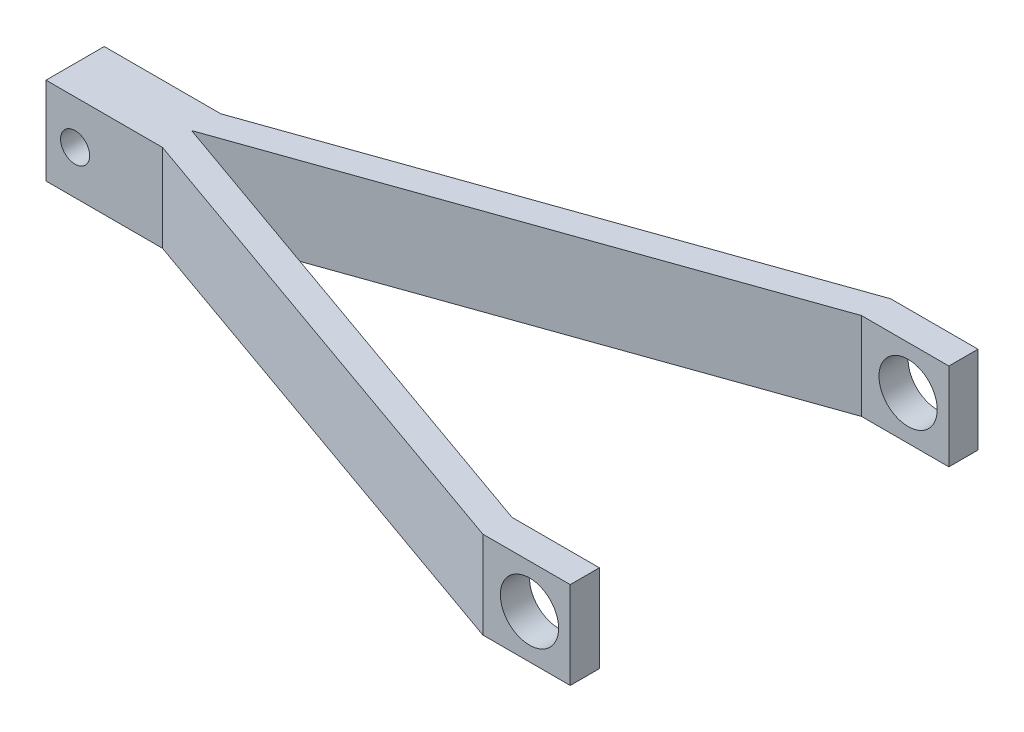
ISO-10303-21;
HEADER;
FILE_DESCRIPTION(('STEP AP214'),'2;1');
FILE_NAME('part.step','',(''),(''),'','','');
FILE_SCHEMA(('AUTOMOTIVE_DESIGN { 1 0 10303 214 1 1 1 1 }'));
ENDSEC;
DATA;
#1=APPLICATION_CONTEXT('core data for automotive mechanical design processes');
#2=APPLICATION_PROTOCOL_DEFINITION('international standard','automotive_design',2000,#1);
#3=PRODUCT_CONTEXT('',#1,'mechanical');
#4=PRODUCT('Part','Part','',(#3));
#5=PRODUCT_RELATED_PRODUCT_CATEGORY('part','',(#4));
#6=PRODUCT_DEFINITION_FORMATION('','',#4);
#7=PRODUCT_DEFINITION_CONTEXT('part definition',#1,'design');
#8=PRODUCT_DEFINITION('design','',#6,#7);
#9=PRODUCT_DEFINITION_SHAPE('','',#8);
#10=(LENGTH_UNIT() NAMED_UNIT(*) SI_UNIT(.MILLI.,.METRE.));
#11=(NAMED_UNIT(*) PLANE_ANGLE_UNIT() SI_UNIT($,.RADIAN.));
#12=(NAMED_UNIT(*) SI_UNIT($,.STERADIAN.) SOLID_ANGLE_UNIT());
#13=UNCERTAINTY_MEASURE_WITH_UNIT(LENGTH_MEASURE(1.E-05),#10,'distance_accuracy_value','');
#14=(GEOMETRIC_REPRESENTATION_CONTEXT(3) GLOBAL_UNCERTAINTY_ASSIGNED_CONTEXT((#13)) GLOBAL_UNIT_ASSIGNED_CONTEXT((#10,
#11,#12)) REPRESENTATION_CONTEXT('',''));
#15=CARTESIAN_POINT('',(0.,0.,0.));
#16=DIRECTION('',(0.,0.,1.));
#17=DIRECTION('',(1.,0.,0.));
#18=AXIS2_PLACEMENT_3D('',#15,#16,#17);
#19=CARTESIAN_POINT('',(99.9999999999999,7.5,2.77555756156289E-13));
#20=DIRECTION('',(-1.,0.,0.));
#21=DIRECTION('',(0.,0.,1.));
#22=AXIS2_PLACEMENT_3D('',#19,#20,#21);
#23=PLANE('',#22);
#24=DIRECTION('',(0.,0.,-1.));
#25=VECTOR('',#24,1.);
#26=CARTESIAN_POINT('',(99.9999999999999,-7.5,2.77555756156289E-13));
#27=LINE('',#26,#25);
#28=CARTESIAN_POINT('',(100.,-7.50000000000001,-30.));
#29=VERTEX_POINT('',#28);
#30=CARTESIAN_POINT('',(100.,-7.50000000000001,-35.));
#31=VERTEX_POINT('',#30);
#32=EDGE_CURVE('E165',#29,#31,#27,.T.);
#33=ORIENTED_EDGE('',*,*,#32,.T.);
#34=DIRECTION('',(0.,-1.,0.));
#35=VECTOR('',#34,1.);
#36=CARTESIAN_POINT('',(100.,7.49999999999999,-35.));
#37=LINE('',#36,#35);
#38=CARTESIAN_POINT('',(100.,7.49999999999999,-35.));
#39=VERTEX_POINT('',#38);
#40=EDGE_CURVE('E11',#39,#31,#37,.T.);
#41=ORIENTED_EDGE('',*,*,#40,.F.);
#42=DIRECTION('',(0.,0.,-1.));
#43=VECTOR('',#42,1.);
#44=CARTESIAN_POINT('',(99.9999999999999,7.5,2.77555756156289E-13));
#45=LINE('',#44,#43);
#46=CARTESIAN_POINT('',(100.,7.49999999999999,-30.));
#47=VERTEX_POINT('',#46);
#48=EDGE_CURVE('E197',#47,#39,#45,.T.);
#49=ORIENTED_EDGE('',*,*,#48,.F.);
#50=DIRECTION('',(0.,-1.,0.));
#51=VECTOR('',#50,1.);
#52=CARTESIAN_POINT('',(100.,7.49999999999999,-30.));
#53=LINE('',#52,#51);
#54=EDGE_CURVE('E164',#47,#29,#53,.T.);
#55=ORIENTED_EDGE('',*,*,#54,.T.);
#56=EDGE_LOOP('',(#33,#41,#49,#55));
#57=FACE_BOUND('',#56,.T.);
#58=ADVANCED_FACE('F36',(#57),#23,.F.);
#59=CARTESIAN_POINT('',(0.,7.5,-35.));
#60=DIRECTION('',(0.,0.,1.));
#61=DIRECTION('',(1.,0.,0.));
#62=AXIS2_PLACEMENT_3D('',#59,#60,#61);
#63=PLANE('',#62);
#64=CARTESIAN_POINT('',(93.,0.,-35.));
#65=DIRECTION('',(0.,0.,1.));
#66=DIRECTION('',(1.,0.,0.));
#67=AXIS2_PLACEMENT_3D('',#64,#65,#66);
#68=CIRCLE('',#67,5.);
#69=CARTESIAN_POINT('',(98.,0.,-35.));
#70=VERTEX_POINT('',#69);
#71=EDGE_CURVE('E371',#70,#70,#68,.T.);
#72=ORIENTED_EDGE('',*,*,#71,.T.);
#73=EDGE_LOOP('',(#72));
#74=FACE_BOUND('',#73,.T.);
#75=DIRECTION('',(-1.,0.,0.));
#76=VECTOR('',#75,1.);
#77=CARTESIAN_POINT('',(0.,-7.50000000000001,-35.));
#78=LINE('',#77,#76);
#79=CARTESIAN_POINT('',(85.,-7.5,-35.));
#80=VERTEX_POINT('',#79);
#81=EDGE_CURVE('E168',#31,#80,#78,.T.);
#82=ORIENTED_EDGE('',*,*,#81,.T.);
#83=DIRECTION('',(0.,-1.,0.));
#84=VECTOR('',#83,1.);
#85=CARTESIAN_POINT('',(85.,7.49999999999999,-35.));
#86=LINE('',#85,#84);
#87=CARTESIAN_POINT('',(85.,7.49999999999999,-35.));
#88=VERTEX_POINT('',#87);
#89=EDGE_CURVE('E45',#88,#80,#86,.T.);
#90=ORIENTED_EDGE('',*,*,#89,.F.);
#91=DIRECTION('',(-1.,0.,0.));
#92=VECTOR('',#91,1.);
#93=CARTESIAN_POINT('',(0.,7.5,-35.));
#94=LINE('',#93,#92);
#95=EDGE_CURVE('E110',#39,#88,#94,.T.);
#96=ORIENTED_EDGE('',*,*,#95,.F.);
#97=ORIENTED_EDGE('',*,*,#40,.T.);
#98=EDGE_LOOP('',(#82,#90,#96,#97));
#99=FACE_BOUND('',#98,.T.);
#100=ADVANCED_FACE('F275',(#74,#99),#63,.F.);
#101=CARTESIAN_POINT('',(-1.56923076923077,7.49999999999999,-4.44615384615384));
#102=DIRECTION('',(0.332820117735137,0.,0.942990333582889));
#103=DIRECTION('',(0.942990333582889,0.,-0.332820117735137));
#104=AXIS2_PLACEMENT_3D('',#101,#102,#103);
#105=PLANE('',#104);
#106=DIRECTION('',(-0.942990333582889,0.,0.332820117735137));
#107=VECTOR('',#106,1.);
#108=CARTESIAN_POINT('',(-1.56923076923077,-7.5,-4.44615384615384));
#109=LINE('',#108,#107);
#110=CARTESIAN_POINT('',(0.,-7.50000000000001,-5.));
#111=VERTEX_POINT('',#110);
#112=EDGE_CURVE('E171',#80,#111,#109,.T.);
#113=ORIENTED_EDGE('',*,*,#112,.T.);
#114=DIRECTION('',(0.,-1.,0.));
#115=VECTOR('',#114,1.);
#116=CARTESIAN_POINT('',(0.,7.5,-5.));
#117=LINE('',#116,#115);
#118=CARTESIAN_POINT('',(0.,7.5,-5.));
#119=VERTEX_POINT('',#118);
#120=EDGE_CURVE('E213',#119,#111,#117,.T.);
#121=ORIENTED_EDGE('',*,*,#120,.F.);
#122=DIRECTION('',(-0.942990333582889,0.,0.332820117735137));
#123=VECTOR('',#122,1.);
#124=CARTESIAN_POINT('',(-1.56923076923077,7.49999999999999,-4.44615384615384));
#125=LINE('',#124,#123);
#126=EDGE_CURVE('E222',#88,#119,#125,.T.);
#127=ORIENTED_EDGE('',*,*,#126,.F.);
#128=ORIENTED_EDGE('',*,*,#89,.T.);
#129=EDGE_LOOP('',(#113,#121,#127,#128));
#130=FACE_BOUND('',#129,.T.);
#131=ADVANCED_FACE('F220',(#130),#105,.F.);
#132=CARTESIAN_POINT('',(0.,7.5,-5.));
#133=DIRECTION('',(0.,0.,1.));
#134=DIRECTION('',(1.,0.,0.));
#135=AXIS2_PLACEMENT_3D('',#132,#133,#134);
#136=PLANE('',#135);
#137=CARTESIAN_POINT('',(-15.,0.,-5.00000000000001));
#138=DIRECTION('',(0.,0.,1.));
#139=DIRECTION('',(1.,0.,0.));
#140=AXIS2_PLACEMENT_3D('',#137,#138,#139);
#141=CIRCLE('',#140,2.5);
#142=CARTESIAN_POINT('',(-12.5,0.,-5.));
#143=VERTEX_POINT('',#142);
#144=EDGE_CURVE('E367',#143,#143,#141,.T.);
#145=ORIENTED_EDGE('',*,*,#144,.T.);
#146=EDGE_LOOP('',(#145));
#147=FACE_BOUND('',#146,.T.);
#148=DIRECTION('',(-1.,0.,0.));
#149=VECTOR('',#148,1.);
#150=CARTESIAN_POINT('',(0.,-7.50000000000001,-5.));
#151=LINE('',#150,#149);
#152=CARTESIAN_POINT('',(-20.,-7.49999999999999,-5.));
#153=VERTEX_POINT('',#152);
#154=EDGE_CURVE('E173',#111,#153,#151,.T.);
#155=ORIENTED_EDGE('',*,*,#154,.T.);
#156=DIRECTION('',(0.,-1.,0.));
#157=VECTOR('',#156,1.);
#158=CARTESIAN_POINT('',(-20.,7.49999999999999,-5.));
#159=LINE('',#158,#157);
#160=CARTESIAN_POINT('',(-20.,7.49999999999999,-5.));
#161=VERTEX_POINT('',#160);
#162=EDGE_CURVE('E211',#161,#153,#159,.T.);
#163=ORIENTED_EDGE('',*,*,#162,.F.);
#164=DIRECTION('',(-1.,0.,0.));
#165=VECTOR('',#164,1.);
#166=CARTESIAN_POINT('',(0.,7.5,-5.));
#167=LINE('',#166,#165);
#168=EDGE_CURVE('E233',#119,#161,#167,.T.);
#169=ORIENTED_EDGE('',*,*,#168,.F.);
#170=ORIENTED_EDGE('',*,*,#120,.T.);
#171=EDGE_LOOP('',(#155,#163,#169,#170));
#172=FACE_BOUND('',#171,.T.);
#173=ADVANCED_FACE('F230',(#147,#172),#136,.F.);
#174=CARTESIAN_POINT('',(-20.,7.49999999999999,0.));
#175=DIRECTION('',(-1.,0.,0.));
#176=DIRECTION('',(0.,0.,1.));
#177=AXIS2_PLACEMENT_3D('',#174,#175,#176);
#178=PLANE('',#177);
#179=DIRECTION('',(0.,0.,-1.));
#180=VECTOR('',#179,1.);
#181=CARTESIAN_POINT('',(-20.,-7.49999999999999,0.));
#182=LINE('',#181,#180);
#183=CARTESIAN_POINT('',(-20.,-7.49999999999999,5.00000000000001));
#184=VERTEX_POINT('',#183);
#185=EDGE_CURVE('E176',#184,#153,#182,.T.);
#186=ORIENTED_EDGE('',*,*,#185,.F.);
#187=DIRECTION('',(0.,-1.,0.));
#188=VECTOR('',#187,1.);
#189=CARTESIAN_POINT('',(-20.,7.49999999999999,5.00000000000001));
#190=LINE('',#189,#188);
#191=CARTESIAN_POINT('',(-20.,7.49999999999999,5.00000000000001));
#192=VERTEX_POINT('',#191);
#193=EDGE_CURVE('E209',#192,#184,#190,.T.);
#194=ORIENTED_EDGE('',*,*,#193,.F.);
#195=DIRECTION('',(0.,0.,-1.));
#196=VECTOR('',#195,1.);
#197=CARTESIAN_POINT('',(-20.,7.49999999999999,0.));
#198=LINE('',#197,#196);
#199=EDGE_CURVE('E235',#192,#161,#198,.T.);
#200=ORIENTED_EDGE('',*,*,#199,.T.);
#201=ORIENTED_EDGE('',*,*,#162,.T.);
#202=EDGE_LOOP('',(#186,#194,#200,#201));
#203=FACE_BOUND('',#202,.T.);
#204=ADVANCED_FACE('F288',(#203),#178,.T.);
#205=CARTESIAN_POINT('',(0.,7.5,5.));
#206=DIRECTION('',(0.,0.,1.));
#207=DIRECTION('',(1.,0.,0.));
#208=AXIS2_PLACEMENT_3D('',#205,#206,#207);
#209=PLANE('',#208);
#210=CARTESIAN_POINT('',(-15.,0.,5.));
#211=DIRECTION('',(0.,0.,1.));
#212=DIRECTION('',(1.,0.,0.));
#213=AXIS2_PLACEMENT_3D('',#210,#211,#212);
#214=CIRCLE('',#213,2.5);
#215=CARTESIAN_POINT('',(-12.5,0.,5.));
#216=VERTEX_POINT('',#215);
#217=EDGE_CURVE('E364',#216,#216,#214,.T.);
#218=ORIENTED_EDGE('',*,*,#217,.F.);
#219=EDGE_LOOP('',(#218));
#220=FACE_BOUND('',#219,.T.);
#221=DIRECTION('',(-1.,0.,0.));
#222=VECTOR('',#221,1.);
#223=CARTESIAN_POINT('',(0.,-7.50000000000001,5.));
#224=LINE('',#223,#222);
#225=CARTESIAN_POINT('',(0.,-7.50000000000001,5.));
#226=VERTEX_POINT('',#225);
#227=EDGE_CURVE('E179',#226,#184,#224,.T.);
#228=ORIENTED_EDGE('',*,*,#227,.F.);
#229=DIRECTION('',(0.,-1.,0.));
#230=VECTOR('',#229,1.);
#231=CARTESIAN_POINT('',(0.,7.5,5.));
#232=LINE('',#231,#230);
#233=CARTESIAN_POINT('',(0.,7.5,5.));
#234=VERTEX_POINT('',#233);
#235=EDGE_CURVE('E207',#234,#226,#232,.T.);
#236=ORIENTED_EDGE('',*,*,#235,.F.);
#237=DIRECTION('',(-1.,0.,0.));
#238=VECTOR('',#237,1.);
#239=CARTESIAN_POINT('',(0.,7.5,5.));
#240=LINE('',#239,#238);
#241=EDGE_CURVE('E237',#234,#192,#240,.T.);
#242=ORIENTED_EDGE('',*,*,#241,.T.);
#243=ORIENTED_EDGE('',*,*,#193,.T.);
#244=EDGE_LOOP('',(#228,#236,#242,#243));
#245=FACE_BOUND('',#244,.T.);
#246=ADVANCED_FACE('F292',(#220,#245),#209,.T.);
#247=CARTESIAN_POINT('',(-1.56923076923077,7.49999999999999,4.44615384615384));
#248=DIRECTION('',(-0.332820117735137,0.,0.942990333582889));
#249=DIRECTION('',(0.942990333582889,0.,0.332820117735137));
#250=AXIS2_PLACEMENT_3D('',#247,#248,#249);
#251=PLANE('',#250);
#252=DIRECTION('',(-0.942990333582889,0.,-0.332820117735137));
#253=VECTOR('',#252,1.);
#254=CARTESIAN_POINT('',(-1.56923076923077,-7.5,4.44615384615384));
#255=LINE('',#254,#253);
#256=CARTESIAN_POINT('',(85.,-7.5,35.));
#257=VERTEX_POINT('',#256);
#258=EDGE_CURVE('E182',#257,#226,#255,.T.);
#259=ORIENTED_EDGE('',*,*,#258,.F.);
#260=DIRECTION('',(0.,-1.,0.));
#261=VECTOR('',#260,1.);
#262=CARTESIAN_POINT('',(85.,7.49999999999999,35.));
#263=LINE('',#262,#261);
#264=CARTESIAN_POINT('',(85.,7.49999999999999,35.));
#265=VERTEX_POINT('',#264);
#266=EDGE_CURVE('E205',#265,#257,#263,.T.);
#267=ORIENTED_EDGE('',*,*,#266,.F.);
#268=DIRECTION('',(-0.942990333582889,0.,-0.332820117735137));
#269=VECTOR('',#268,1.);
#270=CARTESIAN_POINT('',(-1.56923076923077,7.49999999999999,4.44615384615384));
#271=LINE('',#270,#269);
#272=EDGE_CURVE('E244',#265,#234,#271,.T.);
#273=ORIENTED_EDGE('',*,*,#272,.T.);
#274=ORIENTED_EDGE('',*,*,#235,.T.);
#275=EDGE_LOOP('',(#259,#267,#273,#274));
#276=FACE_BOUND('',#275,.T.);
#277=ADVANCED_FACE('F296',(#276),#251,.T.);
#278=CARTESIAN_POINT('',(0.,7.5,35.));
#279=DIRECTION('',(0.,0.,1.));
#280=DIRECTION('',(1.,0.,0.));
#281=AXIS2_PLACEMENT_3D('',#278,#279,#280);
#282=PLANE('',#281);
#283=CARTESIAN_POINT('',(93.,0.,35.));
#284=DIRECTION('',(0.,0.,1.));
#285=DIRECTION('',(1.,0.,0.));
#286=AXIS2_PLACEMENT_3D('',#283,#284,#285);
#287=CIRCLE('',#286,5.);
#288=CARTESIAN_POINT('',(98.,0.,35.));
#289=VERTEX_POINT('',#288);
#290=EDGE_CURVE('E368',#289,#289,#287,.T.);
#291=ORIENTED_EDGE('',*,*,#290,.F.);
#292=EDGE_LOOP('',(#291));
#293=FACE_BOUND('',#292,.T.);
#294=DIRECTION('',(-1.,0.,0.));
#295=VECTOR('',#294,1.);
#296=CARTESIAN_POINT('',(0.,-7.50000000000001,35.));
#297=LINE('',#296,#295);
#298=CARTESIAN_POINT('',(100.,-7.50000000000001,35.));
#299=VERTEX_POINT('',#298);
#300=EDGE_CURVE('E185',#299,#257,#297,.T.);
#301=ORIENTED_EDGE('',*,*,#300,.F.);
#302=DIRECTION('',(0.,-1.,0.));
#303=VECTOR('',#302,1.);
#304=CARTESIAN_POINT('',(100.,7.49999999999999,35.));
#305=LINE('',#304,#303);
#306=CARTESIAN_POINT('',(100.,7.49999999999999,35.));
#307=VERTEX_POINT('',#306);
#308=EDGE_CURVE('E203',#307,#299,#305,.T.);
#309=ORIENTED_EDGE('',*,*,#308,.F.);
#310=DIRECTION('',(-1.,0.,0.));
#311=VECTOR('',#310,1.);
#312=CARTESIAN_POINT('',(0.,7.5,35.));
#313=LINE('',#312,#311);
#314=EDGE_CURVE('E247',#307,#265,#313,.T.);
#315=ORIENTED_EDGE('',*,*,#314,.T.);
#316=ORIENTED_EDGE('',*,*,#266,.T.);
#317=EDGE_LOOP('',(#301,#309,#315,#316));
#318=FACE_BOUND('',#317,.T.);
#319=ADVANCED_FACE('F300',(#293,#318),#282,.T.);
#320=CARTESIAN_POINT('',(99.9999999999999,7.5,-2.77555756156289E-13));
#321=DIRECTION('',(1.,0.,0.));
#322=DIRECTION('',(0.,0.,-1.));
#323=AXIS2_PLACEMENT_3D('',#320,#321,#322);
#324=PLANE('',#323);
#325=DIRECTION('',(0.,0.,1.));
#326=VECTOR('',#325,1.);
#327=CARTESIAN_POINT('',(99.9999999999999,-7.5,-2.77555756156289E-13));
#328=LINE('',#327,#326);
#329=CARTESIAN_POINT('',(100.,-7.50000000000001,30.));
#330=VERTEX_POINT('',#329);
#331=EDGE_CURVE('E188',#330,#299,#328,.T.);
#332=ORIENTED_EDGE('',*,*,#331,.F.);
#333=DIRECTION('',(0.,-1.,0.));
#334=VECTOR('',#333,1.);
#335=CARTESIAN_POINT('',(100.,7.49999999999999,30.));
#336=LINE('',#335,#334);
#337=CARTESIAN_POINT('',(100.,7.49999999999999,30.));
#338=VERTEX_POINT('',#337);
#339=EDGE_CURVE('E201',#338,#330,#336,.T.);
#340=ORIENTED_EDGE('',*,*,#339,.F.);
#341=DIRECTION('',(0.,0.,1.));
#342=VECTOR('',#341,1.);
#343=CARTESIAN_POINT('',(99.9999999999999,7.5,-2.77555756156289E-13));
#344=LINE('',#343,#342);
#345=EDGE_CURVE('E159',#338,#307,#344,.T.);
#346=ORIENTED_EDGE('',*,*,#345,.T.);
#347=ORIENTED_EDGE('',*,*,#308,.T.);
#348=EDGE_LOOP('',(#332,#340,#346,#347));
#349=FACE_BOUND('',#348,.T.);
#350=ADVANCED_FACE('F252',(#349),#324,.T.);
#351=CARTESIAN_POINT('',(0.,7.5,30.));
#352=DIRECTION('',(0.,0.,-1.));
#353=DIRECTION('',(-1.,0.,0.));
#354=AXIS2_PLACEMENT_3D('',#351,#352,#353);
#355=PLANE('',#354);
#356=CARTESIAN_POINT('',(93.,0.,30.));
#357=DIRECTION('',(0.,0.,-1.));
#358=DIRECTION('',(-1.,0.,0.));
#359=AXIS2_PLACEMENT_3D('',#356,#357,#358);
#360=CIRCLE('',#359,5.);
#361=CARTESIAN_POINT('',(98.,0.,30.));
#362=VERTEX_POINT('',#361);
#363=EDGE_CURVE('E169',#362,#362,#360,.T.);
#364=ORIENTED_EDGE('',*,*,#363,.F.);
#365=EDGE_LOOP('',(#364));
#366=FACE_BOUND('',#365,.T.);
#367=DIRECTION('',(1.,0.,0.));
#368=VECTOR('',#367,1.);
#369=CARTESIAN_POINT('',(0.,-7.50000000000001,30.));
#370=LINE('',#369,#368);
#371=CARTESIAN_POINT('',(85.0000000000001,-7.50000000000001,30.));
#372=VERTEX_POINT('',#371);
#373=EDGE_CURVE('E191',#372,#330,#370,.T.);
#374=ORIENTED_EDGE('',*,*,#373,.F.);
#375=DIRECTION('',(0.,-1.,0.));
#376=VECTOR('',#375,1.);
#377=CARTESIAN_POINT('',(85.0000000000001,7.49999999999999,30.));
#378=LINE('',#377,#376);
#379=CARTESIAN_POINT('',(85.0000000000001,7.49999999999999,30.));
#380=VERTEX_POINT('',#379);
#381=EDGE_CURVE('E147',#380,#372,#378,.T.);
#382=ORIENTED_EDGE('',*,*,#381,.F.);
#383=DIRECTION('',(1.,0.,0.));
#384=VECTOR('',#383,1.);
#385=CARTESIAN_POINT('',(0.,7.5,30.));
#386=LINE('',#385,#384);
#387=EDGE_CURVE('E157',#380,#338,#386,.T.);
#388=ORIENTED_EDGE('',*,*,#387,.T.);
#389=ORIENTED_EDGE('',*,*,#339,.T.);
#390=EDGE_LOOP('',(#374,#382,#388,#389));
#391=FACE_BOUND('',#390,.T.);
#392=ADVANCED_FACE('F258',(#366,#391),#355,.T.);
#393=CARTESIAN_POINT('',(0.,7.5,0.));
#394=DIRECTION('',(0.332820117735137,0.,-0.942990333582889));
#395=DIRECTION('',(-0.94299033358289,0.,-0.332820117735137));
#396=AXIS2_PLACEMENT_3D('',#393,#394,#395);
#397=PLANE('',#396);
#398=DIRECTION('',(0.94299033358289,0.,0.332820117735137));
#399=VECTOR('',#398,1.);
#400=CARTESIAN_POINT('',(0.,-7.50000000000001,0.));
#401=LINE('',#400,#399);
#402=CARTESIAN_POINT('',(0.,-7.50000000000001,0.));
#403=VERTEX_POINT('',#402);
#404=EDGE_CURVE('E146',#403,#372,#401,.T.);
#405=ORIENTED_EDGE('',*,*,#404,.F.);
#406=DIRECTION('',(0.,-1.,0.));
#407=VECTOR('',#406,1.);
#408=CARTESIAN_POINT('',(0.,7.5,0.));
#409=LINE('',#408,#407);
#410=CARTESIAN_POINT('',(0.,7.5,0.));
#411=VERTEX_POINT('',#410);
#412=EDGE_CURVE('E140',#411,#403,#409,.T.);
#413=ORIENTED_EDGE('',*,*,#412,.F.);
#414=DIRECTION('',(0.94299033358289,0.,0.332820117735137));
#415=VECTOR('',#414,1.);
#416=CARTESIAN_POINT('',(0.,7.5,0.));
#417=LINE('',#416,#415);
#418=EDGE_CURVE('E144',#411,#380,#417,.T.);
#419=ORIENTED_EDGE('',*,*,#418,.T.);
#420=ORIENTED_EDGE('',*,*,#381,.T.);
#421=EDGE_LOOP('',(#405,#413,#419,#420));
#422=FACE_BOUND('',#421,.T.);
#423=ADVANCED_FACE('F142',(#422),#397,.T.);
#424=CARTESIAN_POINT('',(0.,7.5,0.));
#425=DIRECTION('',(-0.332820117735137,0.,-0.942990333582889));
#426=DIRECTION('',(-0.94299033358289,0.,0.332820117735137));
#427=AXIS2_PLACEMENT_3D('',#424,#425,#426);
#428=PLANE('',#427);
#429=DIRECTION('',(0.94299033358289,0.,-0.332820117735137));
#430=VECTOR('',#429,1.);
#431=CARTESIAN_POINT('',(0.,-7.50000000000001,0.));
#432=LINE('',#431,#430);
#433=CARTESIAN_POINT('',(85.0000000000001,-7.50000000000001,-30.));
#434=VERTEX_POINT('',#433);
#435=EDGE_CURVE('E96',#403,#434,#432,.T.);
#436=ORIENTED_EDGE('',*,*,#435,.T.);
#437=DIRECTION('',(0.,-1.,0.));
#438=VECTOR('',#437,1.);
#439=CARTESIAN_POINT('',(85.0000000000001,7.49999999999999,-30.));
#440=LINE('',#439,#438);
#441=CARTESIAN_POINT('',(85.0000000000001,7.49999999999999,-30.));
#442=VERTEX_POINT('',#441);
#443=EDGE_CURVE('E148',#442,#434,#440,.T.);
#444=ORIENTED_EDGE('',*,*,#443,.F.);
#445=DIRECTION('',(0.94299033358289,0.,-0.332820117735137));
#446=VECTOR('',#445,1.);
#447=CARTESIAN_POINT('',(0.,7.5,0.));
#448=LINE('',#447,#446);
#449=EDGE_CURVE('E150',#411,#442,#448,.T.);
#450=ORIENTED_EDGE('',*,*,#449,.F.);
#451=ORIENTED_EDGE('',*,*,#412,.T.);
#452=EDGE_LOOP('',(#436,#444,#450,#451));
#453=FACE_BOUND('',#452,.T.);
#454=ADVANCED_FACE('F151',(#453),#428,.F.);
#455=CARTESIAN_POINT('',(0.,7.5,-30.));
#456=DIRECTION('',(0.,0.,-1.));
#457=DIRECTION('',(-1.,0.,0.));
#458=AXIS2_PLACEMENT_3D('',#455,#456,#457);
#459=PLANE('',#458);
#460=CARTESIAN_POINT('',(93.,0.,-30.));
#461=DIRECTION('',(0.,0.,-1.));
#462=DIRECTION('',(-1.,0.,0.));
#463=AXIS2_PLACEMENT_3D('',#460,#461,#462);
#464=CIRCLE('',#463,5.);
#465=CARTESIAN_POINT('',(98.,0.,-30.));
#466=VERTEX_POINT('',#465);
#467=EDGE_CURVE('E39',#466,#466,#464,.T.);
#468=ORIENTED_EDGE('',*,*,#467,.T.);
#469=EDGE_LOOP('',(#468));
#470=FACE_BOUND('',#469,.T.);
#471=DIRECTION('',(1.,0.,0.));
#472=VECTOR('',#471,1.);
#473=CARTESIAN_POINT('',(0.,-7.50000000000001,-30.));
#474=LINE('',#473,#472);
#475=EDGE_CURVE('E102',#434,#29,#474,.T.);
#476=ORIENTED_EDGE('',*,*,#475,.T.);
#477=ORIENTED_EDGE('',*,*,#54,.F.);
#478=DIRECTION('',(1.,0.,0.));
#479=VECTOR('',#478,1.);
#480=CARTESIAN_POINT('',(0.,7.5,-30.));
#481=LINE('',#480,#479);
#482=EDGE_CURVE('E53',#442,#47,#481,.T.);
#483=ORIENTED_EDGE('',*,*,#482,.F.);
#484=ORIENTED_EDGE('',*,*,#443,.T.);
#485=EDGE_LOOP('',(#476,#477,#483,#484));
#486=FACE_BOUND('',#485,.T.);
#487=ADVANCED_FACE('F262',(#470,#486),#459,.F.);
#488=CARTESIAN_POINT('',(0.,7.5,0.));
#489=DIRECTION('',(0.,1.,0.));
#490=DIRECTION('',(0.,0.,1.));
#491=AXIS2_PLACEMENT_3D('',#488,#489,#490);
#492=PLANE('',#491);
#493=ORIENTED_EDGE('',*,*,#48,.T.);
#494=ORIENTED_EDGE('',*,*,#95,.T.);
#495=ORIENTED_EDGE('',*,*,#126,.T.);
#496=ORIENTED_EDGE('',*,*,#168,.T.);
#497=ORIENTED_EDGE('',*,*,#199,.F.);
#498=ORIENTED_EDGE('',*,*,#241,.F.);
#499=ORIENTED_EDGE('',*,*,#272,.F.);
#500=ORIENTED_EDGE('',*,*,#314,.F.);
#501=ORIENTED_EDGE('',*,*,#345,.F.);
#502=ORIENTED_EDGE('',*,*,#387,.F.);
#503=ORIENTED_EDGE('',*,*,#418,.F.);
#504=ORIENTED_EDGE('',*,*,#449,.T.);
#505=ORIENTED_EDGE('',*,*,#482,.T.);
#506=EDGE_LOOP('',(#493,#494,#495,#496,#497,#498,#499,#500,#501,#502,#503,#504,#505));
#507=FACE_BOUND('',#506,.T.);
#508=ADVANCED_FACE('F154',(#507),#492,.T.);
#509=CARTESIAN_POINT('',(0.,-7.50000000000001,0.));
#510=DIRECTION('',(0.,1.,0.));
#511=DIRECTION('',(0.,0.,1.));
#512=AXIS2_PLACEMENT_3D('',#509,#510,#511);
#513=PLANE('',#512);
#514=ORIENTED_EDGE('',*,*,#32,.F.);
#515=ORIENTED_EDGE('',*,*,#475,.F.);
#516=ORIENTED_EDGE('',*,*,#435,.F.);
#517=ORIENTED_EDGE('',*,*,#404,.T.);
#518=ORIENTED_EDGE('',*,*,#373,.T.);
#519=ORIENTED_EDGE('',*,*,#331,.T.);
#520=ORIENTED_EDGE('',*,*,#300,.T.);
#521=ORIENTED_EDGE('',*,*,#258,.T.);
#522=ORIENTED_EDGE('',*,*,#227,.T.);
#523=ORIENTED_EDGE('',*,*,#185,.T.);
#524=ORIENTED_EDGE('',*,*,#154,.F.);
#525=ORIENTED_EDGE('',*,*,#112,.F.);
#526=ORIENTED_EDGE('',*,*,#81,.F.);
#527=EDGE_LOOP('',(#514,#515,#516,#517,#518,#519,#520,#521,#522,#523,#524,#525,#526));
#528=FACE_BOUND('',#527,.T.);
#529=ADVANCED_FACE('F226',(#528),#513,.F.);
#530=CARTESIAN_POINT('',(93.,0.,-35.));
#531=DIRECTION('',(0.,0.,1.));
#532=DIRECTION('',(1.,0.,0.));
#533=AXIS2_PLACEMENT_3D('',#530,#531,#532);
#534=CYLINDRICAL_SURFACE('',#533,5.);
#535=CARTESIAN_POINT('',(98.,0.,-35.));
#536=CARTESIAN_POINT('',(98.,0.,-34.9479166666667));
#537=CARTESIAN_POINT('',(98.,0.,-34.8958333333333));
#538=CARTESIAN_POINT('',(98.,0.,-34.7916666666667));
#539=CARTESIAN_POINT('',(98.,0.,-34.7395833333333));
#540=CARTESIAN_POINT('',(98.,0.,-34.6354166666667));
#541=CARTESIAN_POINT('',(98.,0.,-34.5833333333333));
#542=CARTESIAN_POINT('',(98.,0.,-34.4791666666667));
#543=CARTESIAN_POINT('',(98.,0.,-34.4270833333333));
#544=CARTESIAN_POINT('',(98.,0.,-34.3229166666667));
#545=CARTESIAN_POINT('',(98.,0.,-34.2708333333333));
#546=CARTESIAN_POINT('',(98.,0.,-34.1666666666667));
#547=CARTESIAN_POINT('',(98.,0.,-34.1145833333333));
#548=CARTESIAN_POINT('',(98.,0.,-34.0104166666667));
#549=CARTESIAN_POINT('',(98.,0.,-33.9583333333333));
#550=CARTESIAN_POINT('',(98.,0.,-33.8541666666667));
#551=CARTESIAN_POINT('',(98.,0.,-33.8020833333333));
#552=CARTESIAN_POINT('',(98.,0.,-33.6979166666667));
#553=CARTESIAN_POINT('',(98.,0.,-33.6458333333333));
#554=CARTESIAN_POINT('',(98.,0.,-33.5416666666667));
#555=CARTESIAN_POINT('',(98.,0.,-33.4895833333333));
#556=CARTESIAN_POINT('',(98.,0.,-33.3854166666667));
#557=CARTESIAN_POINT('',(98.,0.,-33.3333333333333));
#558=CARTESIAN_POINT('',(98.,0.,-33.2291666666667));
#559=CARTESIAN_POINT('',(98.,0.,-33.1770833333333));
#560=CARTESIAN_POINT('',(98.,0.,-33.0729166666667));
#561=CARTESIAN_POINT('',(98.,0.,-33.0208333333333));
#562=CARTESIAN_POINT('',(98.,0.,-32.9166666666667));
#563=CARTESIAN_POINT('',(98.,0.,-32.8645833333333));
#564=CARTESIAN_POINT('',(98.,0.,-32.7604166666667));
#565=CARTESIAN_POINT('',(98.,0.,-32.7083333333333));
#566=CARTESIAN_POINT('',(98.,0.,-32.6041666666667));
#567=CARTESIAN_POINT('',(98.,0.,-32.5520833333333));
#568=CARTESIAN_POINT('',(98.,0.,-32.4479166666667));
#569=CARTESIAN_POINT('',(98.,0.,-32.3958333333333));
#570=CARTESIAN_POINT('',(98.,0.,-32.2916666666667));
#571=CARTESIAN_POINT('',(98.,0.,-32.2395833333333));
#572=CARTESIAN_POINT('',(98.,0.,-32.1354166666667));
#573=CARTESIAN_POINT('',(98.,0.,-32.0833333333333));
#574=CARTESIAN_POINT('',(98.,0.,-31.9791666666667));
#575=CARTESIAN_POINT('',(98.,0.,-31.9270833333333));
#576=CARTESIAN_POINT('',(98.,0.,-31.8229166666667));
#577=CARTESIAN_POINT('',(98.,0.,-31.7708333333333));
#578=CARTESIAN_POINT('',(98.,0.,-31.6666666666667));
#579=CARTESIAN_POINT('',(98.,0.,-31.6145833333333));
#580=CARTESIAN_POINT('',(98.,0.,-31.5104166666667));
#581=CARTESIAN_POINT('',(98.,0.,-31.4583333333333));
#582=CARTESIAN_POINT('',(98.,0.,-31.3541666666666));
#583=CARTESIAN_POINT('',(98.,0.,-31.3020833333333));
#584=CARTESIAN_POINT('',(98.,0.,-31.1979166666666));
#585=CARTESIAN_POINT('',(98.,0.,-31.1458333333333));
#586=CARTESIAN_POINT('',(98.,0.,-31.0416666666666));
#587=CARTESIAN_POINT('',(98.,0.,-30.9895833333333));
#588=CARTESIAN_POINT('',(98.,0.,-30.8854166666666));
#589=CARTESIAN_POINT('',(98.,0.,-30.8333333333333));
#590=CARTESIAN_POINT('',(98.,0.,-30.7291666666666));
#591=CARTESIAN_POINT('',(98.,0.,-30.6770833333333));
#592=CARTESIAN_POINT('',(98.,0.,-30.5729166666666));
#593=CARTESIAN_POINT('',(98.,0.,-30.5208333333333));
#594=CARTESIAN_POINT('',(98.,0.,-30.4166666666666));
#595=CARTESIAN_POINT('',(98.,0.,-30.3645833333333));
#596=CARTESIAN_POINT('',(98.,0.,-30.2604166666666));
#597=CARTESIAN_POINT('',(98.,0.,-30.2083333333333));
#598=CARTESIAN_POINT('',(98.,0.,-30.1041666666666));
#599=CARTESIAN_POINT('',(98.,0.,-30.0520833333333));
#600=CARTESIAN_POINT('',(98.,0.,-30.));
#601=B_SPLINE_CURVE_WITH_KNOTS('',3,(#535,#536,#537,#538,#539,#540,#541,#542,#543,#544,#545,
#546,#547,#548,#549,#550,#551,#552,#553,#554,#555,#556,#557,#558,#559,#560,#561,#562,#563,#564,
#565,#566,#567,#568,#569,#570,#571,#572,#573,#574,#575,#576,#577,#578,#579,#580,#581,#582,#583,
#584,#585,#586,#587,#588,#589,#590,#591,#592,#593,#594,#595,#596,#597,#598,#599,#600),
.UNSPECIFIED.,.F.,.F.,(4,2,2,2,2,2,2,2,2,2,2,2,2,2,2,2,2,2,2,2,2,2,2,2,2,2,2,2,2,2,2,2,4),(0.,
0.156249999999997,0.3125,0.468749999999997,0.625000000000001,0.781249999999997,
0.937500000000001,1.09375,1.25,1.40625,1.5625,1.71875,1.875,2.03125,2.1875,2.34375000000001,2.5,
2.65625000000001,2.8125,2.96875000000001,3.125,3.28125000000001,3.4375,3.59375000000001,
3.75000000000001,3.90625000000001,4.06250000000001,4.21875000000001,4.37500000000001,
4.53125000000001,4.68750000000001,4.84375000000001,5.00000000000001),.UNSPECIFIED.);
#602=EDGE_CURVE('BSEAM335',#70,#466,#601,.T.);
#603=ORIENTED_EDGE('',*,*,#71,.F.);
#604=ORIENTED_EDGE('',*,*,#467,.F.);
#605=ORIENTED_EDGE('',*,*,#602,.T.);
#606=ORIENTED_EDGE('',*,*,#602,.F.);
#607=EDGE_LOOP('',(#603,#605,#604,#606));
#608=FACE_BOUND('',#607,.T.);
#609=ADVANCED_FACE('F335',(#608),#534,.F.);
#610=CARTESIAN_POINT('',(98.,0.,30.));
#611=CARTESIAN_POINT('',(98.,0.,30.0520833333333));
#612=CARTESIAN_POINT('',(98.,0.,30.1041666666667));
#613=CARTESIAN_POINT('',(98.,0.,30.2083333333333));
#614=CARTESIAN_POINT('',(98.,0.,30.2604166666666));
#615=CARTESIAN_POINT('',(98.,0.,30.3645833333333));
#616=CARTESIAN_POINT('',(98.,0.,30.4166666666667));
#617=CARTESIAN_POINT('',(98.,0.,30.5208333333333));
#618=CARTESIAN_POINT('',(98.,0.,30.5729166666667));
#619=CARTESIAN_POINT('',(98.,0.,30.6770833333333));
#620=CARTESIAN_POINT('',(98.,0.,30.7291666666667));
#621=CARTESIAN_POINT('',(98.,0.,30.8333333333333));
#622=CARTESIAN_POINT('',(98.,0.,30.8854166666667));
#623=CARTESIAN_POINT('',(98.,0.,30.9895833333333));
#624=CARTESIAN_POINT('',(98.,0.,31.0416666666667));
#625=CARTESIAN_POINT('',(98.,0.,31.1458333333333));
#626=CARTESIAN_POINT('',(98.,0.,31.1979166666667));
#627=CARTESIAN_POINT('',(98.,0.,31.3020833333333));
#628=CARTESIAN_POINT('',(98.,0.,31.3541666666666));
#629=CARTESIAN_POINT('',(98.,0.,31.4583333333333));
#630=CARTESIAN_POINT('',(98.,0.,31.5104166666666));
#631=CARTESIAN_POINT('',(98.,0.,31.6145833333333));
#632=CARTESIAN_POINT('',(98.,0.,31.6666666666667));
#633=CARTESIAN_POINT('',(98.,0.,31.7708333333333));
#634=CARTESIAN_POINT('',(98.,0.,31.8229166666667));
#635=CARTESIAN_POINT('',(98.,0.,31.9270833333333));
#636=CARTESIAN_POINT('',(98.,0.,31.9791666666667));
#637=CARTESIAN_POINT('',(98.,0.,32.0833333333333));
#638=CARTESIAN_POINT('',(98.,0.,32.1354166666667));
#639=CARTESIAN_POINT('',(98.,0.,32.2395833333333));
#640=CARTESIAN_POINT('',(98.,0.,32.2916666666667));
#641=CARTESIAN_POINT('',(98.,0.,32.3958333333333));
#642=CARTESIAN_POINT('',(98.,0.,32.4479166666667));
#643=CARTESIAN_POINT('',(98.,0.,32.5520833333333));
#644=CARTESIAN_POINT('',(98.,0.,32.6041666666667));
#645=CARTESIAN_POINT('',(98.,0.,32.7083333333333));
#646=CARTESIAN_POINT('',(98.,0.,32.7604166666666));
#647=CARTESIAN_POINT('',(98.,0.,32.8645833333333));
#648=CARTESIAN_POINT('',(98.,0.,32.9166666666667));
#649=CARTESIAN_POINT('',(98.,0.,33.0208333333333));
#650=CARTESIAN_POINT('',(98.,0.,33.0729166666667));
#651=CARTESIAN_POINT('',(98.,0.,33.1770833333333));
#652=CARTESIAN_POINT('',(98.,0.,33.2291666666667));
#653=CARTESIAN_POINT('',(98.,0.,33.3333333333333));
#654=CARTESIAN_POINT('',(98.,0.,33.3854166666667));
#655=CARTESIAN_POINT('',(98.,0.,33.4895833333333));
#656=CARTESIAN_POINT('',(98.,0.,33.5416666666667));
#657=CARTESIAN_POINT('',(98.,0.,33.6458333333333));
#658=CARTESIAN_POINT('',(98.,0.,33.6979166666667));
#659=CARTESIAN_POINT('',(98.,0.,33.8020833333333));
#660=CARTESIAN_POINT('',(98.,0.,33.8541666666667));
#661=CARTESIAN_POINT('',(98.,0.,33.9583333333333));
#662=CARTESIAN_POINT('',(98.,0.,34.0104166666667));
#663=CARTESIAN_POINT('',(98.,0.,34.1145833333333));
#664=CARTESIAN_POINT('',(98.,0.,34.1666666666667));
#665=CARTESIAN_POINT('',(98.,0.,34.2708333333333));
#666=CARTESIAN_POINT('',(98.,0.,34.3229166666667));
#667=CARTESIAN_POINT('',(98.,0.,34.4270833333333));
#668=CARTESIAN_POINT('',(98.,0.,34.4791666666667));
#669=CARTESIAN_POINT('',(98.,0.,34.5833333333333));
#670=CARTESIAN_POINT('',(98.,0.,34.6354166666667));
#671=CARTESIAN_POINT('',(98.,0.,34.7395833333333));
#672=CARTESIAN_POINT('',(98.,0.,34.7916666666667));
#673=CARTESIAN_POINT('',(98.,0.,34.8958333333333));
#674=CARTESIAN_POINT('',(98.,0.,34.9479166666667));
#675=CARTESIAN_POINT('',(98.,0.,35.));
#676=B_SPLINE_CURVE_WITH_KNOTS('',3,(#610,#611,#612,#613,#614,#615,#616,#617,#618,#619,#620,
#621,#622,#623,#624,#625,#626,#627,#628,#629,#630,#631,#632,#633,#634,#635,#636,#637,#638,#639,
#640,#641,#642,#643,#644,#645,#646,#647,#648,#649,#650,#651,#652,#653,#654,#655,#656,#657,#658,
#659,#660,#661,#662,#663,#664,#665,#666,#667,#668,#669,#670,#671,#672,#673,#674,#675),
.UNSPECIFIED.,.F.,.F.,(4,2,2,2,2,2,2,2,2,2,2,2,2,2,2,2,2,2,2,2,2,2,2,2,2,2,2,2,2,2,2,2,4),(0.,
0.156249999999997,0.312499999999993,0.468750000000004,0.625000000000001,0.781249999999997,
0.937500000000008,1.09375,1.25,1.40625,1.56249999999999,1.71875,1.875,2.03125,2.18750000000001,
2.34375000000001,2.5,2.65625,2.8125,2.96875000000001,3.125,3.28125,3.43750000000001,
3.59375000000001,3.75,3.90625,4.0625,4.21875000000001,4.375,4.53125,4.68750000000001,
4.84375000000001,5.),.UNSPECIFIED.);
#677=EDGE_CURVE('BSEAM344',#362,#289,#676,.T.);
#678=ORIENTED_EDGE('',*,*,#363,.T.);
#679=ORIENTED_EDGE('',*,*,#290,.T.);
#680=ORIENTED_EDGE('',*,*,#677,.T.);
#681=ORIENTED_EDGE('',*,*,#677,.F.);
#682=EDGE_LOOP('',(#678,#680,#679,#681));
#683=FACE_BOUND('',#682,.T.);
#684=ADVANCED_FACE('F344',(#683),#534,.F.);
#685=CARTESIAN_POINT('',(-15.,0.,-35.));
#686=DIRECTION('',(0.,0.,1.));
#687=DIRECTION('',(1.,0.,0.));
#688=AXIS2_PLACEMENT_3D('',#685,#686,#687);
#689=CYLINDRICAL_SURFACE('',#688,2.5);
#690=CARTESIAN_POINT('',(-12.5,0.,5.));
#691=CARTESIAN_POINT('',(-12.5,0.,4.89583333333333));
#692=CARTESIAN_POINT('',(-12.5,0.,4.79166666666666));
#693=CARTESIAN_POINT('',(-12.5,0.,4.58333333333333));
#694=CARTESIAN_POINT('',(-12.5,0.,4.47916666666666));
#695=CARTESIAN_POINT('',(-12.5,0.,4.27083333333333));
#696=CARTESIAN_POINT('',(-12.5,0.,4.16666666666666));
#697=CARTESIAN_POINT('',(-12.5,0.,3.95833333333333));
#698=CARTESIAN_POINT('',(-12.5,0.,3.85416666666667));
#699=CARTESIAN_POINT('',(-12.5,0.,3.64583333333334));
#700=CARTESIAN_POINT('',(-12.5,0.,3.54166666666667));
#701=CARTESIAN_POINT('',(-12.5,0.,3.33333333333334));
#702=CARTESIAN_POINT('',(-12.5,0.,3.22916666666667));
#703=CARTESIAN_POINT('',(-12.5,0.,3.02083333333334));
#704=CARTESIAN_POINT('',(-12.5,0.,2.91666666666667));
#705=CARTESIAN_POINT('',(-12.5,0.,2.70833333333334));
#706=CARTESIAN_POINT('',(-12.5,0.,2.60416666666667));
#707=CARTESIAN_POINT('',(-12.5,0.,2.39583333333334));
#708=CARTESIAN_POINT('',(-12.5,0.,2.29166666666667));
#709=CARTESIAN_POINT('',(-12.5,0.,2.08333333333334));
#710=CARTESIAN_POINT('',(-12.5,0.,1.97916666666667));
#711=CARTESIAN_POINT('',(-12.5,0.,1.77083333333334));
#712=CARTESIAN_POINT('',(-12.5,0.,1.66666666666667));
#713=CARTESIAN_POINT('',(-12.5,0.,1.45833333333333));
#714=CARTESIAN_POINT('',(-12.5,0.,1.35416666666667));
#715=CARTESIAN_POINT('',(-12.5,0.,1.14583333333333));
#716=CARTESIAN_POINT('',(-12.5,0.,1.04166666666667));
#717=CARTESIAN_POINT('',(-12.5,0.,0.833333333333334));
#718=CARTESIAN_POINT('',(-12.5,0.,0.729166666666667));
#719=CARTESIAN_POINT('',(-12.5,0.,0.520833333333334));
#720=CARTESIAN_POINT('',(-12.5,0.,0.416666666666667));
#721=CARTESIAN_POINT('',(-12.5,0.,0.208333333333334));
#722=CARTESIAN_POINT('',(-12.5,0.,0.104166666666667));
#723=CARTESIAN_POINT('',(-12.5,0.,-0.104166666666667));
#724=CARTESIAN_POINT('',(-12.5,0.,-0.208333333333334));
#725=CARTESIAN_POINT('',(-12.5,0.,-0.416666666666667));
#726=CARTESIAN_POINT('',(-12.5,0.,-0.520833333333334));
#727=CARTESIAN_POINT('',(-12.5,0.,-0.729166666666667));
#728=CARTESIAN_POINT('',(-12.5,0.,-0.833333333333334));
#729=CARTESIAN_POINT('',(-12.5,0.,-1.04166666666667));
#730=CARTESIAN_POINT('',(-12.5,0.,-1.14583333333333));
#731=CARTESIAN_POINT('',(-12.5,0.,-1.35416666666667));
#732=CARTESIAN_POINT('',(-12.5,0.,-1.45833333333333));
#733=CARTESIAN_POINT('',(-12.5,0.,-1.66666666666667));
#734=CARTESIAN_POINT('',(-12.5,0.,-1.77083333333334));
#735=CARTESIAN_POINT('',(-12.5,0.,-1.97916666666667));
#736=CARTESIAN_POINT('',(-12.5,0.,-2.08333333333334));
#737=CARTESIAN_POINT('',(-12.5,0.,-2.29166666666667));
#738=CARTESIAN_POINT('',(-12.5,0.,-2.39583333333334));
#739=CARTESIAN_POINT('',(-12.5,0.,-2.60416666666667));
#740=CARTESIAN_POINT('',(-12.5,0.,-2.70833333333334));
#741=CARTESIAN_POINT('',(-12.5,0.,-2.91666666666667));
#742=CARTESIAN_POINT('',(-12.5,0.,-3.02083333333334));
#743=CARTESIAN_POINT('',(-12.5,0.,-3.22916666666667));
#744=CARTESIAN_POINT('',(-12.5,0.,-3.33333333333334));
#745=CARTESIAN_POINT('',(-12.5,0.,-3.54166666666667));
#746=CARTESIAN_POINT('',(-12.5,0.,-3.64583333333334));
#747=CARTESIAN_POINT('',(-12.5,0.,-3.85416666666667));
#748=CARTESIAN_POINT('',(-12.5,0.,-3.95833333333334));
#749=CARTESIAN_POINT('',(-12.5,0.,-4.16666666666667));
#750=CARTESIAN_POINT('',(-12.5,0.,-4.27083333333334));
#751=CARTESIAN_POINT('',(-12.5,0.,-4.47916666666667));
#752=CARTESIAN_POINT('',(-12.5,0.,-4.58333333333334));
#753=CARTESIAN_POINT('',(-12.5,0.,-4.79166666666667));
#754=CARTESIAN_POINT('',(-12.5,0.,-4.89583333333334));
#755=CARTESIAN_POINT('',(-12.5,0.,-5.));
#756=B_SPLINE_CURVE_WITH_KNOTS('',3,(#690,#691,#692,#693,#694,#695,#696,#697,#698,#699,#700,
#701,#702,#703,#704,#705,#706,#707,#708,#709,#710,#711,#712,#713,#714,#715,#716,#717,#718,#719,
#720,#721,#722,#723,#724,#725,#726,#727,#728,#729,#730,#731,#732,#733,#734,#735,#736,#737,#738,
#739,#740,#741,#742,#743,#744,#745,#746,#747,#748,#749,#750,#751,#752,#753,#754,#755),
.UNSPECIFIED.,.F.,.F.,(4,2,2,2,2,2,2,2,2,2,2,2,2,2,2,2,2,2,2,2,2,2,2,2,2,2,2,2,2,2,2,2,4),(0.,
0.3125,0.625000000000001,0.937500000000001,1.24999999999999,1.56249999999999,1.87499999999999,
2.1875,2.5,2.8125,3.125,3.4375,3.75,4.0625,4.375,4.6875,5.,5.3125,5.625,5.9375,6.25,6.5625,
6.875,7.1875,7.5,7.8125,8.125,8.4375,8.75,9.0625,9.375,9.6875,10.),.UNSPECIFIED.);
#757=EDGE_CURVE('BSEAM352',#216,#143,#756,.T.);
#758=ORIENTED_EDGE('',*,*,#217,.T.);
#759=ORIENTED_EDGE('',*,*,#144,.F.);
#760=ORIENTED_EDGE('',*,*,#757,.T.);
#761=ORIENTED_EDGE('',*,*,#757,.F.);
#762=EDGE_LOOP('',(#758,#760,#759,#761));
#763=FACE_BOUND('',#762,.T.);
#764=ADVANCED_FACE('F352',(#763),#689,.F.);
#765=CLOSED_SHELL('',(#58,#100,#131,#173,#204,#246,#277,#319,#350,#392,#423,#454,#487,#508,#529,
#609,#684,#764));
#766=MANIFOLD_SOLID_BREP('B2',#765);
#767=ADVANCED_BREP_SHAPE_REPRESENTATION('',(#18,#766),#14);
#768=SHAPE_DEFINITION_REPRESENTATION(#9,#767);
ENDSEC;
END-ISO-10303-21;
